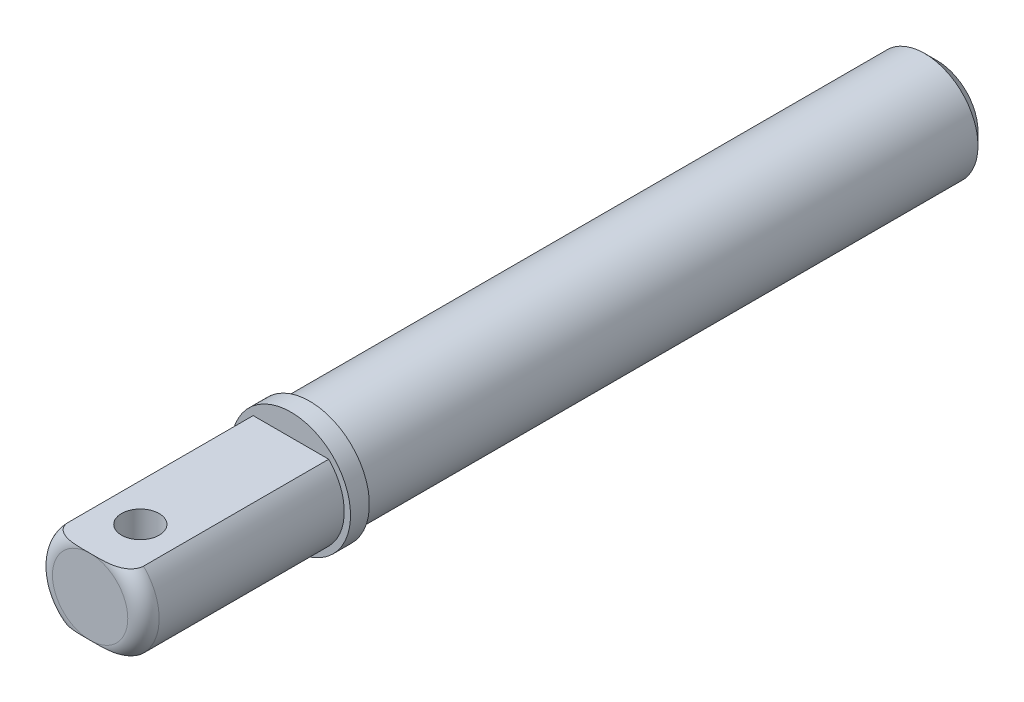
ISO-10303-21;
HEADER;
FILE_DESCRIPTION(('STEP AP214'),'2;1');
FILE_NAME('part.step','',(''),(''),'','','');
FILE_SCHEMA(('AUTOMOTIVE_DESIGN { 1 0 10303 214 1 1 1 1 }'));
ENDSEC;
DATA;
#1=APPLICATION_CONTEXT('core data for automotive mechanical design processes');
#2=APPLICATION_PROTOCOL_DEFINITION('international standard','automotive_design',2000,#1);
#3=PRODUCT_CONTEXT('',#1,'mechanical');
#4=PRODUCT('Part','Part','',(#3));
#5=PRODUCT_RELATED_PRODUCT_CATEGORY('part','',(#4));
#6=PRODUCT_DEFINITION_FORMATION('','',#4);
#7=PRODUCT_DEFINITION_CONTEXT('part definition',#1,'design');
#8=PRODUCT_DEFINITION('design','',#6,#7);
#9=PRODUCT_DEFINITION_SHAPE('','',#8);
#10=(LENGTH_UNIT() NAMED_UNIT(*) SI_UNIT(.MILLI.,.METRE.));
#11=(NAMED_UNIT(*) PLANE_ANGLE_UNIT() SI_UNIT($,.RADIAN.));
#12=(NAMED_UNIT(*) SI_UNIT($,.STERADIAN.) SOLID_ANGLE_UNIT());
#13=UNCERTAINTY_MEASURE_WITH_UNIT(LENGTH_MEASURE(1.E-05),#10,'distance_accuracy_value','');
#14=(GEOMETRIC_REPRESENTATION_CONTEXT(3) GLOBAL_UNCERTAINTY_ASSIGNED_CONTEXT((#13)) GLOBAL_UNIT_ASSIGNED_CONTEXT((#10,
#11,#12)) REPRESENTATION_CONTEXT('',''));
#15=CARTESIAN_POINT('',(0.,0.,0.));
#16=DIRECTION('',(0.,0.,1.));
#17=DIRECTION('',(1.,0.,0.));
#18=AXIS2_PLACEMENT_3D('',#15,#16,#17);
#19=CARTESIAN_POINT('',(0.,0.,135.));
#20=DIRECTION('',(0.,0.,-1.));
#21=DIRECTION('',(-1.,0.,0.));
#22=AXIS2_PLACEMENT_3D('',#19,#20,#21);
#23=CYLINDRICAL_SURFACE('',#22,8.5);
#24=DIRECTION('',(0.,0.,-1.));
#25=VECTOR('',#24,1.);
#26=CARTESIAN_POINT('',(-6.02079728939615,-6.,135.));
#27=LINE('',#26,#25);
#28=CARTESIAN_POINT('',(-6.02079728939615,-6.,132.5));
#29=VERTEX_POINT('',#28);
#30=CARTESIAN_POINT('',(-6.02079728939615,-6.,103.));
#31=VERTEX_POINT('',#30);
#32=EDGE_CURVE('E71',#29,#31,#27,.T.);
#33=ORIENTED_EDGE('',*,*,#32,.F.);
#34=CARTESIAN_POINT('',(0.,0.,132.5));
#35=DIRECTION('',(0.,0.,1.));
#36=DIRECTION('',(1.,0.,0.));
#37=AXIS2_PLACEMENT_3D('',#34,#35,#36);
#38=CIRCLE('',#37,8.5);
#39=CARTESIAN_POINT('',(-6.02079728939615,6.,132.5));
#40=VERTEX_POINT('',#39);
#41=EDGE_CURVE('E11',#29,#40,#38,.F.);
#42=ORIENTED_EDGE('',*,*,#41,.T.);
#43=DIRECTION('',(0.,0.,-1.));
#44=VECTOR('',#43,1.);
#45=CARTESIAN_POINT('',(-6.02079728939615,6.,135.));
#46=LINE('',#45,#44);
#47=CARTESIAN_POINT('',(-6.02079728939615,6.,103.));
#48=VERTEX_POINT('',#47);
#49=EDGE_CURVE('E94',#40,#48,#46,.T.);
#50=ORIENTED_EDGE('',*,*,#49,.T.);
#51=CARTESIAN_POINT('',(0.,0.,103.));
#52=DIRECTION('',(0.,0.,-1.));
#53=DIRECTION('',(-1.,0.,0.));
#54=AXIS2_PLACEMENT_3D('',#51,#52,#53);
#55=CIRCLE('',#54,8.5);
#56=EDGE_CURVE('E87',#31,#48,#55,.T.);
#57=ORIENTED_EDGE('',*,*,#56,.F.);
#58=EDGE_LOOP('',(#33,#42,#50,#57));
#59=FACE_BOUND('',#58,.T.);
#60=ADVANCED_FACE('F26',(#59),#23,.T.);
#61=DIRECTION('',(0.,0.,-1.));
#62=VECTOR('',#61,1.);
#63=CARTESIAN_POINT('',(6.02079728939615,6.,135.));
#64=LINE('',#63,#62);
#65=CARTESIAN_POINT('',(6.02079728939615,6.,103.));
#66=VERTEX_POINT('',#65);
#67=CARTESIAN_POINT('',(6.02079728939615,6.,132.5));
#68=VERTEX_POINT('',#67);
#69=EDGE_CURVE('E237',#66,#68,#64,.F.);
#70=ORIENTED_EDGE('',*,*,#69,.T.);
#71=CARTESIAN_POINT('',(0.,0.,132.5));
#72=DIRECTION('',(0.,0.,1.));
#73=DIRECTION('',(1.,0.,0.));
#74=AXIS2_PLACEMENT_3D('',#71,#72,#73);
#75=CIRCLE('',#74,8.5);
#76=CARTESIAN_POINT('',(6.02079728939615,-6.,132.5));
#77=VERTEX_POINT('',#76);
#78=EDGE_CURVE('E49',#68,#77,#75,.F.);
#79=ORIENTED_EDGE('',*,*,#78,.T.);
#80=DIRECTION('',(0.,0.,-1.));
#81=VECTOR('',#80,1.);
#82=CARTESIAN_POINT('',(6.02079728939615,-6.,135.));
#83=LINE('',#82,#81);
#84=CARTESIAN_POINT('',(6.02079728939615,-6.,103.));
#85=VERTEX_POINT('',#84);
#86=EDGE_CURVE('E79',#85,#77,#83,.F.);
#87=ORIENTED_EDGE('',*,*,#86,.F.);
#88=EDGE_CURVE('E90',#66,#85,#55,.T.);
#89=ORIENTED_EDGE('',*,*,#88,.F.);
#90=EDGE_LOOP('',(#70,#79,#87,#89));
#91=FACE_BOUND('',#90,.T.);
#92=ADVANCED_FACE('F161',(#91),#23,.T.);
#93=CARTESIAN_POINT('',(0.,0.,135.));
#94=DIRECTION('',(0.,0.,1.));
#95=DIRECTION('',(1.,0.,0.));
#96=AXIS2_PLACEMENT_3D('',#93,#94,#95);
#97=PLANE('',#96);
#98=CARTESIAN_POINT('',(0.,0.,135.));
#99=DIRECTION('',(0.,0.,1.));
#100=DIRECTION('',(1.,0.,0.));
#101=AXIS2_PLACEMENT_3D('',#98,#99,#100);
#102=CIRCLE('',#101,6.);
#103=CARTESIAN_POINT('',(0.,6.,135.));
#104=VERTEX_POINT('',#103);
#105=CARTESIAN_POINT('',(0.,-6.,135.));
#106=VERTEX_POINT('',#105);
#107=EDGE_CURVE('E108',#104,#106,#102,.T.);
#108=ORIENTED_EDGE('',*,*,#107,.T.);
#109=CARTESIAN_POINT('',(0.,0.,135.));
#110=DIRECTION('',(0.,0.,1.));
#111=DIRECTION('',(1.,0.,0.));
#112=AXIS2_PLACEMENT_3D('',#109,#110,#111);
#113=CIRCLE('',#112,6.);
#114=EDGE_CURVE('E114',#106,#104,#113,.T.);
#115=ORIENTED_EDGE('',*,*,#114,.T.);
#116=EDGE_LOOP('',(#108,#115));
#117=FACE_BOUND('',#116,.T.);
#118=ADVANCED_FACE('F153',(#117),#97,.T.);
#119=CARTESIAN_POINT('',(0.,0.,103.));
#120=DIRECTION('',(0.,0.,-1.));
#121=DIRECTION('',(-1.,0.,0.));
#122=AXIS2_PLACEMENT_3D('',#119,#120,#121);
#123=PLANE('',#122);
#124=ORIENTED_EDGE('',*,*,#88,.T.);
#125=DIRECTION('',(1.,0.,0.));
#126=VECTOR('',#125,1.);
#127=CARTESIAN_POINT('',(-20.2681443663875,-6.,103.));
#128=LINE('',#127,#126);
#129=EDGE_CURVE('E74',#31,#85,#128,.T.);
#130=ORIENTED_EDGE('',*,*,#129,.F.);
#131=ORIENTED_EDGE('',*,*,#56,.T.);
#132=DIRECTION('',(1.,0.,0.));
#133=VECTOR('',#132,1.);
#134=CARTESIAN_POINT('',(-40.,6.,103.));
#135=LINE('',#134,#133);
#136=EDGE_CURVE('E78',#48,#66,#135,.T.);
#137=ORIENTED_EDGE('',*,*,#136,.T.);
#138=EDGE_LOOP('',(#124,#130,#131,#137));
#139=FACE_BOUND('',#138,.T.);
#140=CARTESIAN_POINT('',(0.,0.,103.));
#141=DIRECTION('',(0.,0.,-1.));
#142=DIRECTION('',(-1.,0.,0.));
#143=AXIS2_PLACEMENT_3D('',#140,#141,#142);
#144=CIRCLE('',#143,9.5);
#145=CARTESIAN_POINT('',(-9.5,0.,103.));
#146=VERTEX_POINT('',#145);
#147=EDGE_CURVE('E99',#146,#146,#144,.T.);
#148=ORIENTED_EDGE('',*,*,#147,.F.);
#149=EDGE_LOOP('',(#148));
#150=FACE_BOUND('',#149,.T.);
#151=ADVANCED_FACE('F84',(#139,#150),#123,.F.);
#152=CARTESIAN_POINT('',(0.,0.,100.));
#153=DIRECTION('',(0.,0.,-1.));
#154=DIRECTION('',(-1.,0.,0.));
#155=AXIS2_PLACEMENT_3D('',#152,#153,#154);
#156=PLANE('',#155);
#157=CARTESIAN_POINT('',(0.,0.,100.));
#158=DIRECTION('',(0.,0.,-1.));
#159=DIRECTION('',(-1.,0.,0.));
#160=AXIS2_PLACEMENT_3D('',#157,#158,#159);
#161=CIRCLE('',#160,9.5);
#162=CARTESIAN_POINT('',(-9.5,0.,100.));
#163=VERTEX_POINT('',#162);
#164=EDGE_CURVE('E240',#163,#163,#161,.T.);
#165=ORIENTED_EDGE('',*,*,#164,.T.);
#166=EDGE_LOOP('',(#165));
#167=FACE_BOUND('',#166,.T.);
#168=CARTESIAN_POINT('',(0.,0.,100.));
#169=DIRECTION('',(0.,0.,-1.));
#170=DIRECTION('',(-1.,0.,0.));
#171=AXIS2_PLACEMENT_3D('',#168,#169,#170);
#172=CIRCLE('',#171,8.5);
#173=CARTESIAN_POINT('',(-8.5,0.,100.));
#174=VERTEX_POINT('',#173);
#175=EDGE_CURVE('E95',#174,#174,#172,.T.);
#176=ORIENTED_EDGE('',*,*,#175,.F.);
#177=EDGE_LOOP('',(#176));
#178=FACE_BOUND('',#177,.T.);
#179=ADVANCED_FACE('F146',(#167,#178),#156,.T.);
#180=CARTESIAN_POINT('',(0.,0.,103.));
#181=DIRECTION('',(0.,0.,-1.));
#182=DIRECTION('',(-1.,0.,0.));
#183=AXIS2_PLACEMENT_3D('',#180,#181,#182);
#184=CYLINDRICAL_SURFACE('',#183,9.5);
#185=ORIENTED_EDGE('',*,*,#147,.T.);
#186=EDGE_LOOP('',(#185));
#187=FACE_BOUND('',#186,.T.);
#188=ORIENTED_EDGE('',*,*,#164,.F.);
#189=EDGE_LOOP('',(#188));
#190=FACE_BOUND('',#189,.T.);
#191=ADVANCED_FACE('F149',(#187,#190),#184,.T.);
#192=CARTESIAN_POINT('',(0.,0.,0.));
#193=DIRECTION('',(0.,0.,1.));
#194=DIRECTION('',(1.,0.,0.));
#195=AXIS2_PLACEMENT_3D('',#192,#193,#194);
#196=PLANE('',#195);
#197=CARTESIAN_POINT('',(0.,0.,0.));
#198=DIRECTION('',(0.,0.,1.));
#199=DIRECTION('',(1.,0.,0.));
#200=AXIS2_PLACEMENT_3D('',#197,#198,#199);
#201=CIRCLE('',#200,6.49999999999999);
#202=CARTESIAN_POINT('',(6.49999999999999,0.,0.));
#203=VERTEX_POINT('',#202);
#204=EDGE_CURVE('E105',#203,#203,#201,.F.);
#205=ORIENTED_EDGE('',*,*,#204,.T.);
#206=EDGE_LOOP('',(#205));
#207=FACE_BOUND('',#206,.T.);
#208=ADVANCED_FACE('F156',(#207),#196,.F.);
#209=CARTESIAN_POINT('',(0.,0.,2.00000000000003));
#210=DIRECTION('',(0.,0.,1.));
#211=DIRECTION('',(1.,0.,0.));
#212=AXIS2_PLACEMENT_3D('',#209,#210,#211);
#213=CIRCLE('',#212,8.5);
#214=CARTESIAN_POINT('',(8.5,0.,2.00000000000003));
#215=VERTEX_POINT('',#214);
#216=EDGE_CURVE('E97',#215,#215,#213,.T.);
#217=ORIENTED_EDGE('',*,*,#216,.T.);
#218=EDGE_LOOP('',(#217));
#219=FACE_BOUND('',#218,.T.);
#220=ORIENTED_EDGE('',*,*,#175,.T.);
#221=EDGE_LOOP('',(#220));
#222=FACE_BOUND('',#221,.T.);
#223=ADVANCED_FACE('F28',(#219,#222),#23,.T.);
#224=CARTESIAN_POINT('',(0.,0.,2.00000000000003));
#225=DIRECTION('',(0.,0.,1.));
#226=DIRECTION('',(1.,0.,0.));
#227=AXIS2_PLACEMENT_3D('',#224,#225,#226);
#228=CONICAL_SURFACE('',#227,8.5,0.785398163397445);
#229=ORIENTED_EDGE('',*,*,#204,.F.);
#230=EDGE_LOOP('',(#229));
#231=FACE_BOUND('',#230,.T.);
#232=ORIENTED_EDGE('',*,*,#216,.F.);
#233=EDGE_LOOP('',(#232));
#234=FACE_BOUND('',#233,.T.);
#235=ADVANCED_FACE('F138',(#231,#234),#228,.T.);
#236=CARTESIAN_POINT('',(30.,6.,103.));
#237=DIRECTION('',(0.,-1.,0.));
#238=DIRECTION('',(0.,0.,-1.));
#239=AXIS2_PLACEMENT_3D('',#236,#237,#238);
#240=PLANE('',#239);
#241=CARTESIAN_POINT('',(0.,6.,127.));
#242=DIRECTION('',(0.,1.,0.));
#243=DIRECTION('',(0.,0.,1.));
#244=AXIS2_PLACEMENT_3D('',#241,#242,#243);
#245=CIRCLE('',#244,3.);
#246=CARTESIAN_POINT('',(0.,6.,130.));
#247=VERTEX_POINT('',#246);
#248=EDGE_CURVE('E111',#247,#247,#245,.T.);
#249=ORIENTED_EDGE('',*,*,#248,.F.);
#250=EDGE_LOOP('',(#249));
#251=FACE_BOUND('',#250,.T.);
#252=CARTESIAN_POINT('',(-6.02079728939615,6.,132.5));
#253=CARTESIAN_POINT('',(-6.02081194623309,6.,132.554591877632));
#254=CARTESIAN_POINT('',(-6.01827326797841,6.,132.609176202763));
#255=CARTESIAN_POINT('',(-6.00820170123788,6.,132.717853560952));
#256=CARTESIAN_POINT('',(-6.00067149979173,6.,132.771946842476));
#257=CARTESIAN_POINT('',(-5.98079607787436,6.,132.878865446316));
#258=CARTESIAN_POINT('',(-5.96848352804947,6.,132.931696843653));
#259=CARTESIAN_POINT('',(-5.93925645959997,6.,133.036058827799));
#260=CARTESIAN_POINT('',(-5.92234154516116,6.,133.087589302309));
#261=CARTESIAN_POINT('',(-5.86513119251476,6.,133.239490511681));
#262=CARTESIAN_POINT('',(-5.81831175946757,6.,133.337475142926));
#263=CARTESIAN_POINT('',(-5.70978737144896,6.,133.524866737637));
#264=CARTESIAN_POINT('',(-5.64805515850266,6.,133.614257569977));
#265=CARTESIAN_POINT('',(-5.49057360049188,6.,133.810513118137));
#266=CARTESIAN_POINT('',(-5.39027285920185,6.,133.913725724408));
#267=CARTESIAN_POINT('',(-5.1744093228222,6.,134.102358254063));
#268=CARTESIAN_POINT('',(-5.05884275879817,6.,134.18777377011));
#269=CARTESIAN_POINT('',(-4.85060961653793,6.,134.320546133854));
#270=CARTESIAN_POINT('',(-4.76042957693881,6.,134.371899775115));
#271=CARTESIAN_POINT('',(-4.57586693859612,6.,134.466507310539));
#272=CARTESIAN_POINT('',(-4.48148190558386,6.,134.509756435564));
#273=CARTESIAN_POINT('',(-4.28877358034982,6.,134.589215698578));
#274=CARTESIAN_POINT('',(-4.19042132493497,6.,134.625354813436));
#275=CARTESIAN_POINT('',(-3.991585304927,6.,134.690853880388));
#276=CARTESIAN_POINT('',(-3.891103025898,6.,134.720218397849));
#277=CARTESIAN_POINT('',(-3.63172856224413,6.,134.787836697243));
#278=CARTESIAN_POINT('',(-3.47172568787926,6.,134.821820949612));
#279=CARTESIAN_POINT('',(-3.14966430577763,6.,134.878286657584));
#280=CARTESIAN_POINT('',(-2.98760418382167,6.,134.900758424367));
#281=CARTESIAN_POINT('',(-2.66169541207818,6.,134.93702255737));
#282=CARTESIAN_POINT('',(-2.49784183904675,6.,134.950768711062));
#283=CARTESIAN_POINT('',(-2.16971954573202,6.,134.971931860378));
#284=CARTESIAN_POINT('',(-2.0054507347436,6.,134.979347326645));
#285=CARTESIAN_POINT('',(-1.68683493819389,6.,134.989733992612));
#286=CARTESIAN_POINT('',(-1.53249492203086,6.,134.992949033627));
#287=CARTESIAN_POINT('',(-1.22378217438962,6.,134.997277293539));
#288=CARTESIAN_POINT('',(-1.06940944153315,6.,134.998390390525));
#289=CARTESIAN_POINT('',(-0.762517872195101,6.,134.999676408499));
#290=CARTESIAN_POINT('',(-0.609999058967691,6.,134.999860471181));
#291=CARTESIAN_POINT('',(-0.381233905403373,6.,134.999978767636));
#292=CARTESIAN_POINT('',(-0.304987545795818,6.,134.999991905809));
#293=CARTESIAN_POINT('',(-0.152494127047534,6.,135.00000049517));
#294=CARTESIAN_POINT('',(-0.0762470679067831,6.,134.999995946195));
#295=CARTESIAN_POINT('',(0.,6.,135.));
#296=B_SPLINE_CURVE_WITH_KNOTS('',3,(#252,#253,#254,#255,#256,#257,#258,#259,#260,#261,#262,
#263,#264,#265,#266,#267,#268,#269,#270,#271,#272,#273,#274,#275,#276,#277,#278,#279,#280,#281,
#282,#283,#284,#285,#286,#287,#288,#289,#290,#291,#292,#293,#294,#295),.UNSPECIFIED.,.F.,.F.,(4,
2,2,2,2,2,2,2,2,2,2,2,2,2,2,2,2,2,2,2,2,4),(0.,0.163704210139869,0.327320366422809,
0.489837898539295,0.652369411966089,0.976515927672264,1.30125947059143,1.73065382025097,
2.16015438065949,2.47107565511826,2.7821793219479,3.0962483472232,3.41010510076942,
3.90022812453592,4.39076295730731,4.88387454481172,5.37710522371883,5.84020227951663,
6.30332619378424,6.76088254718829,6.98962164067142,7.21836282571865),.UNSPECIFIED.);
#297=EDGE_CURVE('E117',#40,#104,#296,.T.);
#298=ORIENTED_EDGE('',*,*,#297,.T.);
#299=CARTESIAN_POINT('',(0.,6.,135.));
#300=CARTESIAN_POINT('',(0.122464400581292,6.,134.999964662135));
#301=CARTESIAN_POINT('',(0.244928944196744,6.,134.999998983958));
#302=CARTESIAN_POINT('',(0.489863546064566,6.,134.999950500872));
#303=CARTESIAN_POINT('',(0.612333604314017,6.,134.999867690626));
#304=CARTESIAN_POINT('',(0.857649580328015,6.,134.999327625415));
#305=CARTESIAN_POINT('',(0.980495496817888,6.,134.998869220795));
#306=CARTESIAN_POINT('',(1.22618038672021,6.,134.997080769));
#307=CARTESIAN_POINT('',(1.34901936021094,6.,134.995750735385));
#308=CARTESIAN_POINT('',(1.59679417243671,6.,134.991539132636));
#309=CARTESIAN_POINT('',(1.72172961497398,6.,134.988631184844));
#310=CARTESIAN_POINT('',(1.97153480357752,6.,134.980416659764));
#311=CARTESIAN_POINT('',(2.09640454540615,6.,134.975109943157));
#312=CARTESIAN_POINT('',(2.34579890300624,6.,134.961149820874));
#313=CARTESIAN_POINT('',(2.47032375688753,6.,134.95250086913));
#314=CARTESIAN_POINT('',(2.71898544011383,6.,134.930794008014));
#315=CARTESIAN_POINT('',(2.84312232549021,6.,134.917736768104));
#316=CARTESIAN_POINT('',(3.06937848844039,6.,134.888780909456));
#317=CARTESIAN_POINT('',(3.17160842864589,6.,134.873758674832));
#318=CARTESIAN_POINT('',(3.37532904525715,6.,134.839191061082));
#319=CARTESIAN_POINT('',(3.47681960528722,6.,134.819644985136));
#320=CARTESIAN_POINT('',(3.67856737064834,6.,134.77531380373));
#321=CARTESIAN_POINT('',(3.77882561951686,6.,134.750533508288));
#322=CARTESIAN_POINT('',(3.97767549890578,6.,134.694962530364));
#323=CARTESIAN_POINT('',(4.07626721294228,6.,134.664172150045));
#324=CARTESIAN_POINT('',(4.27262995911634,6.,134.595267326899));
#325=CARTESIAN_POINT('',(4.37036360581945,6.,134.557045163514));
#326=CARTESIAN_POINT('',(4.56248215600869,6.,134.472788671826));
#327=CARTESIAN_POINT('',(4.65686573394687,6.,134.426751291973));
#328=CARTESIAN_POINT('',(4.84072429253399,6.,134.32629470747));
#329=CARTESIAN_POINT('',(4.93021380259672,6.,134.271902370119));
#330=CARTESIAN_POINT('',(5.10301553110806,6.,134.154078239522));
#331=CARTESIAN_POINT('',(5.1863303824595,6.,134.090650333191));
#332=CARTESIAN_POINT('',(5.35856371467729,6.,133.942675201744));
#333=CARTESIAN_POINT('',(5.44600015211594,6.,133.856371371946));
#334=CARTESIAN_POINT('',(5.60627984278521,6.,133.67102626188));
#335=CARTESIAN_POINT('',(5.67912365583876,6.,133.571985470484));
#336=CARTESIAN_POINT('',(5.8068819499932,6.,133.361365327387));
#337=CARTESIAN_POINT('',(5.86161701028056,6.,133.249674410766));
#338=CARTESIAN_POINT('',(5.92654288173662,6.,133.075980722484));
#339=CARTESIAN_POINT('',(5.94531742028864,6.,133.017084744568));
#340=CARTESIAN_POINT('',(5.97683028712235,6.,132.89771176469));
#341=CARTESIAN_POINT('',(5.98957269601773,6.,132.837235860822));
#342=CARTESIAN_POINT('',(6.00634711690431,6.,132.73057738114));
#343=CARTESIAN_POINT('',(6.01176115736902,6.,132.684606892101));
#344=CARTESIAN_POINT('',(6.01898758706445,6.,132.592427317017));
#345=CARTESIAN_POINT('',(6.02080333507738,6.,132.546218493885));
#346=CARTESIAN_POINT('',(6.02079728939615,6.,132.5));
#347=B_SPLINE_CURVE_WITH_KNOTS('',3,(#299,#300,#301,#302,#303,#304,#305,#306,#307,#308,#309,
#310,#311,#312,#313,#314,#315,#316,#317,#318,#319,#320,#321,#322,#323,#324,#325,#326,#327,#328,
#329,#330,#331,#332,#333,#334,#335,#336,#337,#338,#339,#340,#341,#342,#343,#344,#345,#346),
.UNSPECIFIED.,.F.,.F.,(4,2,2,2,2,2,2,2,2,2,2,2,2,2,2,2,2,2,2,2,2,2,2,4),(0.,0.367393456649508,
0.734803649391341,1.10334266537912,1.47187594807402,1.84676898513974,2.22168379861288,
2.59610070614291,2.97046077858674,3.28036041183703,3.59030781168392,3.89997161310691,
4.20961984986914,4.52414526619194,4.83879377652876,5.15245086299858,5.46597342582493,
5.83316384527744,6.20034017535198,6.57105252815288,6.75624061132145,6.94130323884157,
7.0800344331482,7.21863606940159),.UNSPECIFIED.);
#348=EDGE_CURVE('E125',#104,#68,#347,.T.);
#349=ORIENTED_EDGE('',*,*,#348,.T.);
#350=ORIENTED_EDGE('',*,*,#69,.F.);
#351=ORIENTED_EDGE('',*,*,#136,.F.);
#352=ORIENTED_EDGE('',*,*,#49,.F.);
#353=EDGE_LOOP('',(#298,#349,#350,#351,#352));
#354=FACE_BOUND('',#353,.T.);
#355=ADVANCED_FACE('F133',(#251,#354),#240,.F.);
#356=CARTESIAN_POINT('',(19.8035450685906,-6.,103.));
#357=DIRECTION('',(0.,-1.,0.));
#358=DIRECTION('',(0.,0.,-1.));
#359=AXIS2_PLACEMENT_3D('',#356,#357,#358);
#360=PLANE('',#359);
#361=CARTESIAN_POINT('',(0.,-6.,127.));
#362=DIRECTION('',(0.,-1.,0.));
#363=DIRECTION('',(0.,0.,-1.));
#364=AXIS2_PLACEMENT_3D('',#361,#362,#363);
#365=CIRCLE('',#364,3.);
#366=CARTESIAN_POINT('',(0.,-6.,124.));
#367=VERTEX_POINT('',#366);
#368=EDGE_CURVE('E91',#367,#367,#365,.T.);
#369=ORIENTED_EDGE('',*,*,#368,.F.);
#370=EDGE_LOOP('',(#369));
#371=FACE_BOUND('',#370,.T.);
#372=ORIENTED_EDGE('',*,*,#86,.T.);
#373=CARTESIAN_POINT('',(6.02079728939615,-6.,132.5));
#374=CARTESIAN_POINT('',(6.02081194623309,-6.,132.554591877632));
#375=CARTESIAN_POINT('',(6.01827326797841,-6.,132.609176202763));
#376=CARTESIAN_POINT('',(6.00820170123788,-6.,132.717853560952));
#377=CARTESIAN_POINT('',(6.00067149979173,-6.,132.771946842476));
#378=CARTESIAN_POINT('',(5.98079607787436,-6.,132.878865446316));
#379=CARTESIAN_POINT('',(5.96848352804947,-6.,132.931696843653));
#380=CARTESIAN_POINT('',(5.93925645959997,-6.,133.036058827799));
#381=CARTESIAN_POINT('',(5.92234154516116,-6.,133.087589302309));
#382=CARTESIAN_POINT('',(5.86513119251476,-6.,133.239490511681));
#383=CARTESIAN_POINT('',(5.81831175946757,-6.,133.337475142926));
#384=CARTESIAN_POINT('',(5.70978737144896,-6.,133.524866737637));
#385=CARTESIAN_POINT('',(5.64805515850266,-6.,133.614257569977));
#386=CARTESIAN_POINT('',(5.49057360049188,-6.,133.810513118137));
#387=CARTESIAN_POINT('',(5.39027285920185,-6.,133.913725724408));
#388=CARTESIAN_POINT('',(5.1744093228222,-6.,134.102358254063));
#389=CARTESIAN_POINT('',(5.05884275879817,-6.,134.18777377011));
#390=CARTESIAN_POINT('',(4.85060961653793,-6.,134.320546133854));
#391=CARTESIAN_POINT('',(4.76042957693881,-6.,134.371899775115));
#392=CARTESIAN_POINT('',(4.57586693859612,-6.,134.466507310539));
#393=CARTESIAN_POINT('',(4.48148190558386,-6.,134.509756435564));
#394=CARTESIAN_POINT('',(4.28877358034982,-6.,134.589215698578));
#395=CARTESIAN_POINT('',(4.19042132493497,-6.,134.625354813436));
#396=CARTESIAN_POINT('',(3.991585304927,-6.,134.690853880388));
#397=CARTESIAN_POINT('',(3.891103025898,-6.,134.720218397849));
#398=CARTESIAN_POINT('',(3.63172856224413,-6.,134.787836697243));
#399=CARTESIAN_POINT('',(3.47172568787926,-6.,134.821820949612));
#400=CARTESIAN_POINT('',(3.14966430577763,-6.,134.878286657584));
#401=CARTESIAN_POINT('',(2.98760418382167,-6.,134.900758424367));
#402=CARTESIAN_POINT('',(2.66169541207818,-6.,134.93702255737));
#403=CARTESIAN_POINT('',(2.49784183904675,-6.,134.950768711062));
#404=CARTESIAN_POINT('',(2.16971954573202,-6.,134.971931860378));
#405=CARTESIAN_POINT('',(2.0054507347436,-6.,134.979347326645));
#406=CARTESIAN_POINT('',(1.68683493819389,-6.,134.989733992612));
#407=CARTESIAN_POINT('',(1.53249492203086,-6.,134.992949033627));
#408=CARTESIAN_POINT('',(1.22378217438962,-6.,134.997277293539));
#409=CARTESIAN_POINT('',(1.06940944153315,-6.,134.998390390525));
#410=CARTESIAN_POINT('',(0.762517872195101,-6.,134.999676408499));
#411=CARTESIAN_POINT('',(0.609999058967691,-6.,134.999860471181));
#412=CARTESIAN_POINT('',(0.381233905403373,-6.,134.999978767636));
#413=CARTESIAN_POINT('',(0.304987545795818,-6.,134.999991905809));
#414=CARTESIAN_POINT('',(0.152494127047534,-6.,135.00000049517));
#415=CARTESIAN_POINT('',(0.0762470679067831,-6.,134.999995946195));
#416=CARTESIAN_POINT('',(0.,-6.,135.));
#417=B_SPLINE_CURVE_WITH_KNOTS('',3,(#373,#374,#375,#376,#377,#378,#379,#380,#381,#382,#383,
#384,#385,#386,#387,#388,#389,#390,#391,#392,#393,#394,#395,#396,#397,#398,#399,#400,#401,#402,
#403,#404,#405,#406,#407,#408,#409,#410,#411,#412,#413,#414,#415,#416),.UNSPECIFIED.,.F.,.F.,(4,
2,2,2,2,2,2,2,2,2,2,2,2,2,2,2,2,2,2,2,2,4),(0.,0.163704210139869,0.327320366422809,
0.489837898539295,0.652369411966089,0.976515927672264,1.30125947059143,1.73065382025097,
2.16015438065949,2.47107565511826,2.7821793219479,3.0962483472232,3.41010510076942,
3.90022812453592,4.39076295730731,4.88387454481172,5.37710522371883,5.84020227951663,
6.30332619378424,6.76088254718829,6.98962164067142,7.21836282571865),.UNSPECIFIED.);
#418=EDGE_CURVE('E34',#77,#106,#417,.T.);
#419=ORIENTED_EDGE('',*,*,#418,.T.);
#420=CARTESIAN_POINT('',(0.,-6.,135.));
#421=CARTESIAN_POINT('',(-0.122464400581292,-6.,134.999964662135));
#422=CARTESIAN_POINT('',(-0.244928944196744,-6.,134.999998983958));
#423=CARTESIAN_POINT('',(-0.489863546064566,-6.,134.999950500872));
#424=CARTESIAN_POINT('',(-0.612333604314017,-6.,134.999867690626));
#425=CARTESIAN_POINT('',(-0.857649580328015,-6.,134.999327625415));
#426=CARTESIAN_POINT('',(-0.980495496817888,-6.,134.998869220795));
#427=CARTESIAN_POINT('',(-1.22618038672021,-6.,134.997080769));
#428=CARTESIAN_POINT('',(-1.34901936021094,-6.,134.995750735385));
#429=CARTESIAN_POINT('',(-1.59679417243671,-6.,134.991539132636));
#430=CARTESIAN_POINT('',(-1.72172961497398,-6.,134.988631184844));
#431=CARTESIAN_POINT('',(-1.97153480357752,-6.,134.980416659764));
#432=CARTESIAN_POINT('',(-2.09640454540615,-6.,134.975109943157));
#433=CARTESIAN_POINT('',(-2.34579890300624,-6.,134.961149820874));
#434=CARTESIAN_POINT('',(-2.47032375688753,-6.,134.95250086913));
#435=CARTESIAN_POINT('',(-2.71898544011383,-6.,134.930794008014));
#436=CARTESIAN_POINT('',(-2.84312232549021,-6.,134.917736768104));
#437=CARTESIAN_POINT('',(-3.06937848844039,-6.,134.888780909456));
#438=CARTESIAN_POINT('',(-3.17160842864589,-6.,134.873758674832));
#439=CARTESIAN_POINT('',(-3.37532904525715,-6.,134.839191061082));
#440=CARTESIAN_POINT('',(-3.47681960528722,-6.,134.819644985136));
#441=CARTESIAN_POINT('',(-3.67856737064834,-6.,134.77531380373));
#442=CARTESIAN_POINT('',(-3.77882561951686,-6.,134.750533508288));
#443=CARTESIAN_POINT('',(-3.97767549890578,-6.,134.694962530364));
#444=CARTESIAN_POINT('',(-4.07626721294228,-6.,134.664172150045));
#445=CARTESIAN_POINT('',(-4.27262995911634,-6.,134.595267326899));
#446=CARTESIAN_POINT('',(-4.37036360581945,-6.,134.557045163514));
#447=CARTESIAN_POINT('',(-4.56248215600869,-6.,134.472788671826));
#448=CARTESIAN_POINT('',(-4.65686573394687,-6.,134.426751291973));
#449=CARTESIAN_POINT('',(-4.84072429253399,-6.,134.32629470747));
#450=CARTESIAN_POINT('',(-4.93021380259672,-6.,134.271902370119));
#451=CARTESIAN_POINT('',(-5.10301553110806,-6.,134.154078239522));
#452=CARTESIAN_POINT('',(-5.1863303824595,-6.,134.090650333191));
#453=CARTESIAN_POINT('',(-5.35856371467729,-6.,133.942675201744));
#454=CARTESIAN_POINT('',(-5.44600015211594,-6.,133.856371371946));
#455=CARTESIAN_POINT('',(-5.60627984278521,-6.,133.67102626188));
#456=CARTESIAN_POINT('',(-5.67912365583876,-6.,133.571985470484));
#457=CARTESIAN_POINT('',(-5.8068819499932,-6.,133.361365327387));
#458=CARTESIAN_POINT('',(-5.86161701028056,-6.,133.249674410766));
#459=CARTESIAN_POINT('',(-5.92654288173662,-6.,133.075980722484));
#460=CARTESIAN_POINT('',(-5.94531742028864,-6.,133.017084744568));
#461=CARTESIAN_POINT('',(-5.97683028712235,-6.,132.89771176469));
#462=CARTESIAN_POINT('',(-5.98957269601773,-6.,132.837235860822));
#463=CARTESIAN_POINT('',(-6.00634711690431,-6.,132.73057738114));
#464=CARTESIAN_POINT('',(-6.01176115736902,-6.,132.684606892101));
#465=CARTESIAN_POINT('',(-6.01898758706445,-6.,132.592427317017));
#466=CARTESIAN_POINT('',(-6.02080333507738,-6.,132.546218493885));
#467=CARTESIAN_POINT('',(-6.02079728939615,-6.,132.5));
#468=B_SPLINE_CURVE_WITH_KNOTS('',3,(#420,#421,#422,#423,#424,#425,#426,#427,#428,#429,#430,
#431,#432,#433,#434,#435,#436,#437,#438,#439,#440,#441,#442,#443,#444,#445,#446,#447,#448,#449,
#450,#451,#452,#453,#454,#455,#456,#457,#458,#459,#460,#461,#462,#463,#464,#465,#466,#467),
.UNSPECIFIED.,.F.,.F.,(4,2,2,2,2,2,2,2,2,2,2,2,2,2,2,2,2,2,2,2,2,2,2,4),(0.,0.367393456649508,
0.734803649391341,1.10334266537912,1.47187594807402,1.84676898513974,2.22168379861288,
2.59610070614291,2.97046077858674,3.28036041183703,3.59030781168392,3.89997161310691,
4.20961984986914,4.52414526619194,4.83879377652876,5.15245086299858,5.46597342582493,
5.83316384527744,6.20034017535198,6.57105252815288,6.75624061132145,6.94130323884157,
7.0800344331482,7.21863606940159),.UNSPECIFIED.);
#469=EDGE_CURVE('E41',#106,#29,#468,.T.);
#470=ORIENTED_EDGE('',*,*,#469,.T.);
#471=ORIENTED_EDGE('',*,*,#32,.T.);
#472=ORIENTED_EDGE('',*,*,#129,.T.);
#473=EDGE_LOOP('',(#372,#419,#470,#471,#472));
#474=FACE_BOUND('',#473,.T.);
#475=ADVANCED_FACE('F73',(#371,#474),#360,.T.);
#476=CARTESIAN_POINT('',(0.,-14.,127.));
#477=DIRECTION('',(0.,1.,0.));
#478=DIRECTION('',(0.,0.,1.));
#479=AXIS2_PLACEMENT_3D('',#476,#477,#478);
#480=CYLINDRICAL_SURFACE('',#479,3.);
#481=ORIENTED_EDGE('',*,*,#368,.T.);
#482=EDGE_LOOP('',(#481));
#483=FACE_BOUND('',#482,.T.);
#484=ORIENTED_EDGE('',*,*,#248,.T.);
#485=EDGE_LOOP('',(#484));
#486=FACE_BOUND('',#485,.T.);
#487=ADVANCED_FACE('F196',(#483,#486),#480,.F.);
#488=CARTESIAN_POINT('',(0.,0.,132.5));
#489=DIRECTION('',(0.,0.,1.));
#490=DIRECTION('',(1.,0.,0.));
#491=AXIS2_PLACEMENT_3D('',#488,#489,#490);
#492=TOROIDAL_SURFACE('',#491,6.,2.5);
#493=ORIENTED_EDGE('',*,*,#418,.F.);
#494=ORIENTED_EDGE('',*,*,#78,.F.);
#495=ORIENTED_EDGE('',*,*,#348,.F.);
#496=ORIENTED_EDGE('',*,*,#114,.F.);
#497=EDGE_LOOP('',(#493,#494,#495,#496));
#498=FACE_BOUND('',#497,.T.);
#499=ADVANCED_FACE('F204',(#498),#492,.T.);
#500=CARTESIAN_POINT('',(0.,0.,132.5));
#501=DIRECTION('',(0.,0.,1.));
#502=DIRECTION('',(1.,0.,0.));
#503=AXIS2_PLACEMENT_3D('',#500,#501,#502);
#504=TOROIDAL_SURFACE('',#503,6.,2.5);
#505=ORIENTED_EDGE('',*,*,#297,.F.);
#506=ORIENTED_EDGE('',*,*,#41,.F.);
#507=ORIENTED_EDGE('',*,*,#469,.F.);
#508=ORIENTED_EDGE('',*,*,#107,.F.);
#509=EDGE_LOOP('',(#505,#506,#507,#508));
#510=FACE_BOUND('',#509,.T.);
#511=ADVANCED_FACE('F131',(#510),#504,.T.);
#512=CLOSED_SHELL('',(#60,#92,#118,#151,#179,#191,#208,#223,#235,#355,#475,#487,#499,#511));
#513=MANIFOLD_SOLID_BREP('B2',#512);
#514=ADVANCED_BREP_SHAPE_REPRESENTATION('',(#18,#513),#14);
#515=SHAPE_DEFINITION_REPRESENTATION(#9,#514);
ENDSEC;
END-ISO-10303-21;
